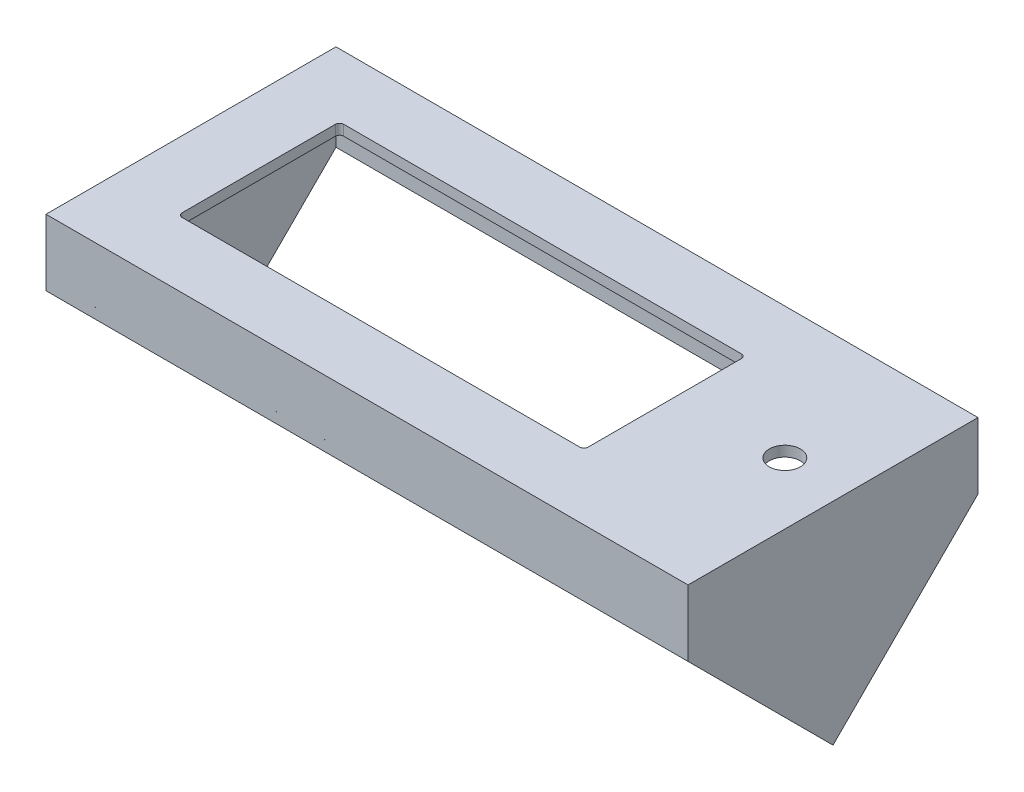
from build123d import *

# Parameters (mm, degrees)
SKIZZE1_W                       = 150
SKIZZE1_H                       = 65
AUFSATZ_LINEAR_AUSTRAGEN1_DEPTH = 2.5
SCHNITT_LINEAR_AUSTRAGEN1_DEPTH = 2.5
SKIZZE3_R                       = 3.75
SCHNITT_LINEAR_AUSTRAGEN2_DEPTH = 2.5
SKIZZE4_W                       = 155
SKIZZE4_H                       = 70
SKIZZE4_W_2                     = 150
SKIZZE4_H_2                     = 65
AUFSATZ_LINEAR_AUSTRAGEN2_DEPTH = 16
AUFSATZ_LINEAR_AUSTRAGEN3_DEPTH = 2.5
AUFSATZ_LINEAR_AUSTRAGEN5_DEPTH = 2.5
AUFSATZ_LINEAR_AUSTRAGEN6_DEPTH = 150
AUFSATZ_LINEAR_AUSTRAGEN7_DEPTH = 150


with BuildPart() as part:
    # Skizze1 → Aufsatz-Linear austragen1 (new body)
    with BuildSketch(Plane(origin=(0, 0, 0), x_dir=(1, 0, 0), z_dir=(0, 1, 0))):
        with Locations((-20.030864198, -0.200617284)):
            Rectangle(SKIZZE1_W, SKIZZE1_H)
    extrude(amount=AUFSATZ_LINEAR_AUSTRAGEN1_DEPTH)

    # Skizze2 → Schnitt-Linear austragen1 (cut)
    with BuildSketch(Plane(origin=(0, 2.5, 0), x_dir=(1, 0, 0), z_dir=(0, 1, 0))):
        with BuildLine():
            Line((-80.410864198, 19.549382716), (15.589135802, 19.549382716))
            ThreePointArc((15.589135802, 19.549382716), (16.296242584, 19.256489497), (16.589135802, 18.549382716))
            Line((16.589135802, 18.549382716), (16.589135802, -18.450617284))
            ThreePointArc((16.589135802, -18.450617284), (16.296242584, -19.157724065), (15.589135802, -19.450617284))
            Line((15.589135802, -19.450617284), (-80.410864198, -19.450617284))
            ThreePointArc((-80.410864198, -19.450617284), (-81.117970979, -19.157724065), (-81.410864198, -18.450617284))
            Line((-81.410864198, -18.450617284), (-81.410864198, 18.549382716))
            ThreePointArc((-81.410864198, 18.549382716), (-81.117970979, 19.256489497), (-80.410864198, 19.549382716))
        make_face()
    extrude(amount=-SCHNITT_LINEAR_AUSTRAGEN1_DEPTH, mode=Mode.SUBTRACT)

    # Skizze3 → Schnitt-Linear austragen2 (cut)
    with BuildSketch(Plane(origin=(0, 2.5, 0), x_dir=(1, 0, 0), z_dir=(0, 1, 0))):
        with Locations(Location((42.589135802, 3.049382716, 0), (0, 0, 270))):
            Circle(SKIZZE3_R)
    extrude(amount=-SCHNITT_LINEAR_AUSTRAGEN2_DEPTH, mode=Mode.SUBTRACT)

    # Skizze4 → Aufsatz-Linear austragen2 (add)
    with BuildSketch(Plane(origin=(0, 2.5, 0), x_dir=(1, 0, 0), z_dir=(0, 1, 0))):
        with Locations((-20.030864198, -0.200617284)):
            Rectangle(SKIZZE4_W, SKIZZE4_H)
        with Locations((-20.030864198, -0.200617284)):
            Rectangle(SKIZZE4_W_2, SKIZZE4_H_2, mode=Mode.SUBTRACT)
    extrude(amount=-AUFSATZ_LINEAR_AUSTRAGEN2_DEPTH)

    # 3D-Skizze1 → Aufsatz-Linear austragen3 (add)
    with BuildSketch(Plane(origin=(-97.530864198, -48.5, 0.200617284), x_dir=(0, 0.7071067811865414, 0.7071067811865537), z_dir=(-1, 0, 0))):
        Polygon((0, 0), (0, 49.497474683), (49.497474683, 0), align=None)
    extrude(amount=-AUFSATZ_LINEAR_AUSTRAGEN3_DEPTH)

    # 3D-Skizze2 → Aufsatz-Linear austragen5 (add)
    with BuildSketch(Plane(origin=(57.469135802, -13.5, -34.799382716), x_dir=(0, 0, 1), z_dir=(1, 0, 0))):
        Polygon((0, 0), (70, 0), (35, 35), align=None)
    extrude(amount=-AUFSATZ_LINEAR_AUSTRAGEN5_DEPTH)

    # 3D-Skizze3 → Aufsatz-Linear austragen6 (add)
    with BuildSketch(Plane(origin=(54.969135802, -13.5, 32.700617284), x_dir=(0, -0.7327934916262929, -0.6804510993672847), z_dir=(-1, 0, 0))):
        Polygon((0, 0), (-1.701127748, 1.831983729), (47.762432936, 0), (47.696922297, -1.768787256), align=None)
    extrude(amount=AUFSATZ_LINEAR_AUSTRAGEN6_DEPTH)

    # 3D-Skizze4 → Aufsatz-Linear austragen7 (add)
    with BuildSketch(Plane(origin=(-95.030864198, -13.5, -34.799382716), x_dir=(3.9252311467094e-15, -0.7071067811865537, 0.7071067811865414), z_dir=(-1, 0, 0))):
        Polygon((0, 0), (1.767766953, 1.767766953), (3.535533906, 0), align=None)
    extrude(amount=-AUFSATZ_LINEAR_AUSTRAGEN7_DEPTH)


solid = part.part
